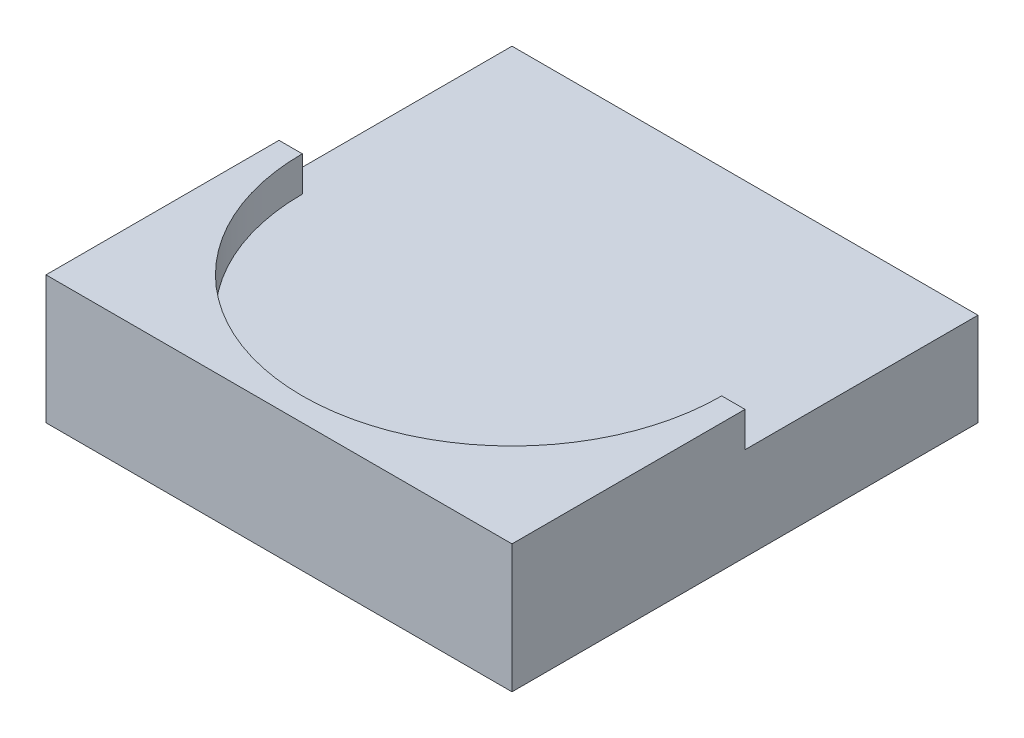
from build123d import *

# Parameters (mm, degrees)
CROQUIS1_W              = 4
CROQUIS1_H              = 4
SALIENTE_EXTRUIR1_DEPTH = 1.1
CORTAR_EXTRUIR1_DEPTH   = 0.3


with BuildPart() as part:
    # Croquis1 → Saliente-Extruir1 (new body)
    with BuildSketch(Plane(origin=(0, 0, 0), x_dir=(1, 0, 0), z_dir=(0, 1, 0))):
        with Locations((2, -2)):
            Rectangle(CROQUIS1_W, CROQUIS1_H)
    extrude(amount=SALIENTE_EXTRUIR1_DEPTH)

    # Croquis2 → Cortar-Extruir1 (cut)
    with BuildSketch(Plane(origin=(0, 1.1, 0), x_dir=(1, 0, 0), z_dir=(0, 1, 0))):
        with BuildLine():
            Line((0.2, -2), (0, -2))
            Line((0, -2), (0, 0))
            Line((0, 0), (4, 0))
            Line((4, 0), (4, -2))
            Line((4, -2), (3.8, -2))
            ThreePointArc((3.8, -2), (2, -3.8), (0.2, -2))
        make_face()
    extrude(amount=-CORTAR_EXTRUIR1_DEPTH, mode=Mode.SUBTRACT)


solid = part.part
